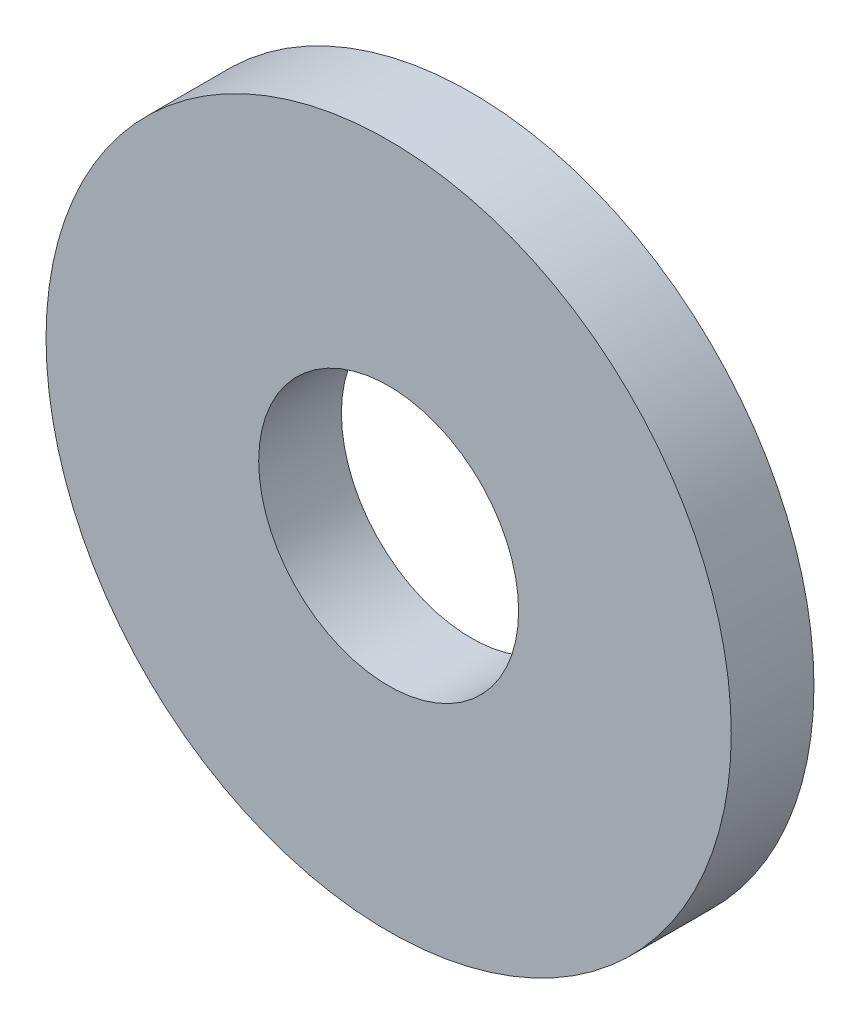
ISO-10303-21;
HEADER;
FILE_DESCRIPTION(('STEP AP214'),'2;1');
FILE_NAME('part.step','',(''),(''),'','','');
FILE_SCHEMA(('AUTOMOTIVE_DESIGN { 1 0 10303 214 1 1 1 1 }'));
ENDSEC;
DATA;
#1=APPLICATION_CONTEXT('core data for automotive mechanical design processes');
#2=APPLICATION_PROTOCOL_DEFINITION('international standard','automotive_design',2000,#1);
#3=PRODUCT_CONTEXT('',#1,'mechanical');
#4=PRODUCT('Part','Part','',(#3));
#5=PRODUCT_RELATED_PRODUCT_CATEGORY('part','',(#4));
#6=PRODUCT_DEFINITION_FORMATION('','',#4);
#7=PRODUCT_DEFINITION_CONTEXT('part definition',#1,'design');
#8=PRODUCT_DEFINITION('design','',#6,#7);
#9=PRODUCT_DEFINITION_SHAPE('','',#8);
#10=(LENGTH_UNIT() NAMED_UNIT(*) SI_UNIT(.MILLI.,.METRE.));
#11=(NAMED_UNIT(*) PLANE_ANGLE_UNIT() SI_UNIT($,.RADIAN.));
#12=(NAMED_UNIT(*) SI_UNIT($,.STERADIAN.) SOLID_ANGLE_UNIT());
#13=UNCERTAINTY_MEASURE_WITH_UNIT(LENGTH_MEASURE(1.E-05),#10,'distance_accuracy_value','');
#14=(GEOMETRIC_REPRESENTATION_CONTEXT(3) GLOBAL_UNCERTAINTY_ASSIGNED_CONTEXT((#13)) GLOBAL_UNIT_ASSIGNED_CONTEXT((#10,
#11,#12)) REPRESENTATION_CONTEXT('',''));
#15=CARTESIAN_POINT('',(0.,0.,0.));
#16=DIRECTION('',(0.,0.,1.));
#17=DIRECTION('',(1.,0.,0.));
#18=AXIS2_PLACEMENT_3D('',#15,#16,#17);
#19=CARTESIAN_POINT('',(0.,0.,0.7));
#20=DIRECTION('',(0.,0.,1.));
#21=DIRECTION('',(1.,0.,0.));
#22=AXIS2_PLACEMENT_3D('',#19,#20,#21);
#23=PLANE('',#22);
#24=CARTESIAN_POINT('',(0.,0.,0.7));
#25=DIRECTION('',(0.,0.,1.));
#26=DIRECTION('',(1.,0.,0.));
#27=AXIS2_PLACEMENT_3D('',#24,#25,#26);
#28=CIRCLE('',#27,2.9);
#29=CARTESIAN_POINT('',(2.9,0.,0.7));
#30=VERTEX_POINT('',#29);
#31=EDGE_CURVE('E10',#30,#30,#28,.T.);
#32=ORIENTED_EDGE('',*,*,#31,.T.);
#33=EDGE_LOOP('',(#32));
#34=FACE_BOUND('',#33,.T.);
#35=CARTESIAN_POINT('',(0.,0.,0.7));
#36=DIRECTION('',(0.,0.,1.));
#37=DIRECTION('',(1.,0.,0.));
#38=AXIS2_PLACEMENT_3D('',#35,#36,#37);
#39=CIRCLE('',#38,1.1);
#40=CARTESIAN_POINT('',(1.1,0.,0.7));
#41=VERTEX_POINT('',#40);
#42=EDGE_CURVE('E43',#41,#41,#39,.T.);
#43=ORIENTED_EDGE('',*,*,#42,.F.);
#44=EDGE_LOOP('',(#43));
#45=FACE_BOUND('',#44,.T.);
#46=ADVANCED_FACE('F32',(#34,#45),#23,.T.);
#47=CARTESIAN_POINT('',(0.,0.,0.));
#48=DIRECTION('',(0.,0.,1.));
#49=DIRECTION('',(1.,0.,0.));
#50=AXIS2_PLACEMENT_3D('',#47,#48,#49);
#51=PLANE('',#50);
#52=CARTESIAN_POINT('',(0.,0.,0.));
#53=DIRECTION('',(0.,0.,1.));
#54=DIRECTION('',(1.,0.,0.));
#55=AXIS2_PLACEMENT_3D('',#52,#53,#54);
#56=CIRCLE('',#55,2.9);
#57=CARTESIAN_POINT('',(2.9,0.,0.));
#58=VERTEX_POINT('',#57);
#59=EDGE_CURVE('E36',#58,#58,#56,.T.);
#60=ORIENTED_EDGE('',*,*,#59,.F.);
#61=EDGE_LOOP('',(#60));
#62=FACE_BOUND('',#61,.T.);
#63=CARTESIAN_POINT('',(0.,0.,0.));
#64=DIRECTION('',(0.,0.,1.));
#65=DIRECTION('',(1.,0.,0.));
#66=AXIS2_PLACEMENT_3D('',#63,#64,#65);
#67=CIRCLE('',#66,1.1);
#68=CARTESIAN_POINT('',(1.1,0.,0.));
#69=VERTEX_POINT('',#68);
#70=EDGE_CURVE('E45',#69,#69,#67,.T.);
#71=ORIENTED_EDGE('',*,*,#70,.T.);
#72=EDGE_LOOP('',(#71));
#73=FACE_BOUND('',#72,.T.);
#74=ADVANCED_FACE('F55',(#62,#73),#51,.F.);
#75=CARTESIAN_POINT('',(0.,0.,0.7));
#76=DIRECTION('',(0.,0.,-1.));
#77=DIRECTION('',(-1.,0.,0.));
#78=AXIS2_PLACEMENT_3D('',#75,#76,#77);
#79=CYLINDRICAL_SURFACE('',#78,2.9);
#80=ORIENTED_EDGE('',*,*,#31,.F.);
#81=EDGE_LOOP('',(#80));
#82=FACE_BOUND('',#81,.T.);
#83=ORIENTED_EDGE('',*,*,#59,.T.);
#84=EDGE_LOOP('',(#83));
#85=FACE_BOUND('',#84,.T.);
#86=ADVANCED_FACE('F34',(#82,#85),#79,.T.);
#87=CARTESIAN_POINT('',(0.,0.,0.7));
#88=DIRECTION('',(0.,0.,-1.));
#89=DIRECTION('',(-1.,0.,0.));
#90=AXIS2_PLACEMENT_3D('',#87,#88,#89);
#91=CYLINDRICAL_SURFACE('',#90,1.1);
#92=ORIENTED_EDGE('',*,*,#42,.T.);
#93=EDGE_LOOP('',(#92));
#94=FACE_BOUND('',#93,.T.);
#95=ORIENTED_EDGE('',*,*,#70,.F.);
#96=EDGE_LOOP('',(#95));
#97=FACE_BOUND('',#96,.T.);
#98=ADVANCED_FACE('F51',(#94,#97),#91,.F.);
#99=CLOSED_SHELL('',(#46,#74,#86,#98));
#100=MANIFOLD_SOLID_BREP('B2',#99);
#101=ADVANCED_BREP_SHAPE_REPRESENTATION('',(#18,#100),#14);
#102=SHAPE_DEFINITION_REPRESENTATION(#9,#101);
ENDSEC;
END-ISO-10303-21;
